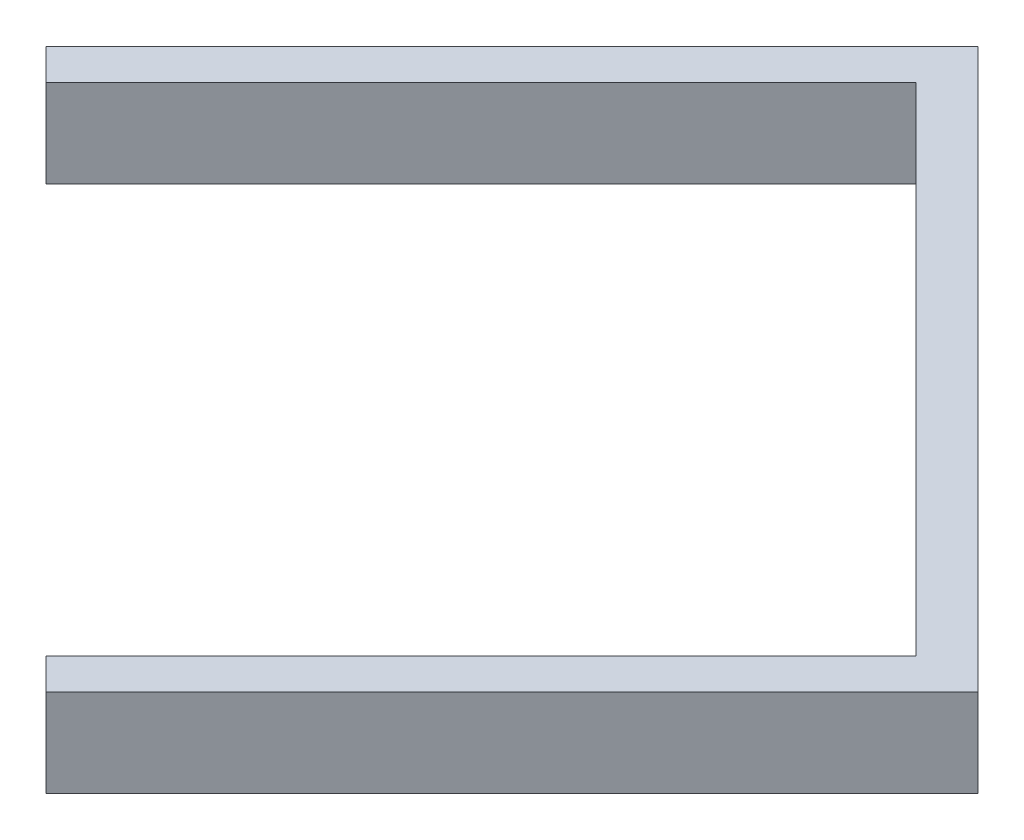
ISO-10303-21;
HEADER;
FILE_DESCRIPTION(('STEP AP214'),'2;1');
FILE_NAME('part.step','',(''),(''),'','','');
FILE_SCHEMA(('AUTOMOTIVE_DESIGN { 1 0 10303 214 1 1 1 1 }'));
ENDSEC;
DATA;
#1=APPLICATION_CONTEXT('core data for automotive mechanical design processes');
#2=APPLICATION_PROTOCOL_DEFINITION('international standard','automotive_design',2000,#1);
#3=PRODUCT_CONTEXT('',#1,'mechanical');
#4=PRODUCT('Part','Part','',(#3));
#5=PRODUCT_RELATED_PRODUCT_CATEGORY('part','',(#4));
#6=PRODUCT_DEFINITION_FORMATION('','',#4);
#7=PRODUCT_DEFINITION_CONTEXT('part definition',#1,'design');
#8=PRODUCT_DEFINITION('design','',#6,#7);
#9=PRODUCT_DEFINITION_SHAPE('','',#8);
#10=(LENGTH_UNIT() NAMED_UNIT(*) SI_UNIT(.MILLI.,.METRE.));
#11=(NAMED_UNIT(*) PLANE_ANGLE_UNIT() SI_UNIT($,.RADIAN.));
#12=(NAMED_UNIT(*) SI_UNIT($,.STERADIAN.) SOLID_ANGLE_UNIT());
#13=UNCERTAINTY_MEASURE_WITH_UNIT(LENGTH_MEASURE(1.E-05),#10,'distance_accuracy_value','');
#14=(GEOMETRIC_REPRESENTATION_CONTEXT(3) GLOBAL_UNCERTAINTY_ASSIGNED_CONTEXT((#13)) GLOBAL_UNIT_ASSIGNED_CONTEXT((#10,
#11,#12)) REPRESENTATION_CONTEXT('',''));
#15=CARTESIAN_POINT('',(0.,0.,0.));
#16=DIRECTION('',(0.,0.,1.));
#17=DIRECTION('',(1.,0.,0.));
#18=AXIS2_PLACEMENT_3D('',#15,#16,#17);
#19=CARTESIAN_POINT('',(-179.895576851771,50.8,-179.895576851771));
#20=DIRECTION('',(0.707106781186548,0.,0.707106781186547));
#21=DIRECTION('',(0.707106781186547,0.,-0.707106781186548));
#22=AXIS2_PLACEMENT_3D('',#19,#20,#21);
#23=PLANE('',#22);
#24=DIRECTION('',(-0.707106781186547,0.,0.707106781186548));
#25=VECTOR('',#24,1.);
#26=CARTESIAN_POINT('',(-179.895576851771,0.,-179.895576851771));
#27=LINE('',#26,#25);
#28=CARTESIAN_POINT('',(-60.5381574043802,0.,-299.252996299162));
#29=VERTEX_POINT('',#28);
#30=CARTESIAN_POINT('',(-311.985328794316,0.,-47.8058249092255));
#31=VERTEX_POINT('',#30);
#32=EDGE_CURVE('E145',#29,#31,#27,.T.);
#33=ORIENTED_EDGE('',*,*,#32,.F.);
#34=DIRECTION('',(0.,-1.,0.));
#35=VECTOR('',#34,1.);
#36=CARTESIAN_POINT('',(-60.5381574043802,50.8,-299.252996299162));
#37=LINE('',#36,#35);
#38=CARTESIAN_POINT('',(-60.5381574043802,50.8,-299.252996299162));
#39=VERTEX_POINT('',#38);
#40=EDGE_CURVE('E11',#39,#29,#37,.T.);
#41=ORIENTED_EDGE('',*,*,#40,.F.);
#42=DIRECTION('',(-0.707106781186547,0.,0.707106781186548));
#43=VECTOR('',#42,1.);
#44=CARTESIAN_POINT('',(-179.895576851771,50.8,-179.895576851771));
#45=LINE('',#44,#43);
#46=CARTESIAN_POINT('',(-311.985328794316,50.8,-47.8058249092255));
#47=VERTEX_POINT('',#46);
#48=EDGE_CURVE('E174',#39,#47,#45,.T.);
#49=ORIENTED_EDGE('',*,*,#48,.T.);
#50=DIRECTION('',(0.,-1.,0.));
#51=VECTOR('',#50,1.);
#52=CARTESIAN_POINT('',(-311.985328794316,50.8,-47.8058249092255));
#53=LINE('',#52,#51);
#54=EDGE_CURVE('E64',#47,#31,#53,.T.);
#55=ORIENTED_EDGE('',*,*,#54,.T.);
#56=EDGE_LOOP('',(#33,#41,#49,#55));
#57=FACE_BOUND('',#56,.T.);
#58=ADVANCED_FACE('F47',(#57),#23,.T.);
#59=CARTESIAN_POINT('',(119.357419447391,50.8,-119.357419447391));
#60=DIRECTION('',(-0.707106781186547,0.,0.707106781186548));
#61=DIRECTION('',(0.707106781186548,0.,0.707106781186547));
#62=AXIS2_PLACEMENT_3D('',#59,#60,#61);
#63=PLANE('',#62);
#64=CARTESIAN_POINT('',(119.357419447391,25.4,-119.357419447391));
#65=DIRECTION('',(-0.707106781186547,0.,0.707106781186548));
#66=DIRECTION('',(0.707106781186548,0.,0.707106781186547));
#67=AXIS2_PLACEMENT_3D('',#64,#65,#66);
#68=CIRCLE('',#67,6.35000000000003);
#69=CARTESIAN_POINT('',(114.867291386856,25.4,-123.847547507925));
#70=VERTEX_POINT('',#69);
#71=EDGE_CURVE('E149',#70,#70,#68,.T.);
#72=ORIENTED_EDGE('',*,*,#71,.F.);
#73=EDGE_LOOP('',(#72));
#74=FACE_BOUND('',#73,.T.);
#75=DIRECTION('',(-0.707106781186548,0.,-0.707106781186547));
#76=VECTOR('',#75,1.);
#77=CARTESIAN_POINT('',(119.357419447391,0.,-119.357419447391));
#78=LINE('',#77,#76);
#79=CARTESIAN_POINT('',(226.830038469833,0.,-11.884800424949));
#80=VERTEX_POINT('',#79);
#81=EDGE_CURVE('E148',#80,#29,#78,.T.);
#82=ORIENTED_EDGE('',*,*,#81,.F.);
#83=DIRECTION('',(0.,-1.,0.));
#84=VECTOR('',#83,1.);
#85=CARTESIAN_POINT('',(226.830038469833,50.8,-11.884800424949));
#86=LINE('',#85,#84);
#87=CARTESIAN_POINT('',(226.830038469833,50.8,-11.884800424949));
#88=VERTEX_POINT('',#87);
#89=EDGE_CURVE('E56',#88,#80,#86,.T.);
#90=ORIENTED_EDGE('',*,*,#89,.F.);
#91=DIRECTION('',(-0.707106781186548,0.,-0.707106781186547));
#92=VECTOR('',#91,1.);
#93=CARTESIAN_POINT('',(119.357419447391,50.8,-119.357419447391));
#94=LINE('',#93,#92);
#95=EDGE_CURVE('E206',#88,#39,#94,.T.);
#96=ORIENTED_EDGE('',*,*,#95,.T.);
#97=ORIENTED_EDGE('',*,*,#40,.T.);
#98=EDGE_LOOP('',(#82,#90,#96,#97));
#99=FACE_BOUND('',#98,.T.);
#100=ADVANCED_FACE('F197',(#74,#99),#63,.T.);
#101=CARTESIAN_POINT('',(107.472619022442,50.8,107.472619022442));
#102=DIRECTION('',(-0.707106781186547,0.,-0.707106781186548));
#103=DIRECTION('',(-0.707106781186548,0.,0.707106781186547));
#104=AXIS2_PLACEMENT_3D('',#101,#102,#103);
#105=PLANE('',#104);
#106=DIRECTION('',(0.707106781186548,0.,-0.707106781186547));
#107=VECTOR('',#106,1.);
#108=CARTESIAN_POINT('',(107.472619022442,0.,107.472619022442));
#109=LINE('',#108,#107);
#110=CARTESIAN_POINT('',(-24.6171329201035,0.,239.562370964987));
#111=VERTEX_POINT('',#110);
#112=EDGE_CURVE('E153',#111,#80,#109,.T.);
#113=ORIENTED_EDGE('',*,*,#112,.F.);
#114=DIRECTION('',(0.,-1.,0.));
#115=VECTOR('',#114,1.);
#116=CARTESIAN_POINT('',(-24.6171329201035,50.8,239.562370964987));
#117=LINE('',#116,#115);
#118=CARTESIAN_POINT('',(-24.6171329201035,50.8,239.562370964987));
#119=VERTEX_POINT('',#118);
#120=EDGE_CURVE('E184',#119,#111,#117,.T.);
#121=ORIENTED_EDGE('',*,*,#120,.F.);
#122=DIRECTION('',(0.707106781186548,0.,-0.707106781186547));
#123=VECTOR('',#122,1.);
#124=CARTESIAN_POINT('',(107.472619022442,50.8,107.472619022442));
#125=LINE('',#124,#123);
#126=EDGE_CURVE('E193',#119,#88,#125,.T.);
#127=ORIENTED_EDGE('',*,*,#126,.T.);
#128=ORIENTED_EDGE('',*,*,#89,.T.);
#129=EDGE_LOOP('',(#113,#121,#127,#128));
#130=FACE_BOUND('',#129,.T.);
#131=ADVANCED_FACE('F191',(#130),#105,.T.);
#132=CARTESIAN_POINT('',(-132.089751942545,50.8,132.089751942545));
#133=DIRECTION('',(-0.707106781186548,0.,0.707106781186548));
#134=DIRECTION('',(0.707106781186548,0.,0.707106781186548));
#135=AXIS2_PLACEMENT_3D('',#132,#133,#134);
#136=PLANE('',#135);
#137=DIRECTION('',(-0.707106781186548,0.,-0.707106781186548));
#138=VECTOR('',#137,1.);
#139=CARTESIAN_POINT('',(-132.089751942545,0.,132.089751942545));
#140=LINE('',#139,#138);
#141=CARTESIAN_POINT('',(-6.65662067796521,0.,257.522883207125));
#142=VERTEX_POINT('',#141);
#143=EDGE_CURVE('E157',#142,#111,#140,.T.);
#144=ORIENTED_EDGE('',*,*,#143,.F.);
#145=DIRECTION('',(0.,-1.,0.));
#146=VECTOR('',#145,1.);
#147=CARTESIAN_POINT('',(-6.65662067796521,50.8,257.522883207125));
#148=LINE('',#147,#146);
#149=CARTESIAN_POINT('',(-6.65662067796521,50.8,257.522883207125));
#150=VERTEX_POINT('',#149);
#151=EDGE_CURVE('E181',#150,#142,#148,.T.);
#152=ORIENTED_EDGE('',*,*,#151,.F.);
#153=DIRECTION('',(-0.707106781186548,0.,-0.707106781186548));
#154=VECTOR('',#153,1.);
#155=CARTESIAN_POINT('',(-132.089751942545,50.8,132.089751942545));
#156=LINE('',#155,#154);
#157=EDGE_CURVE('E205',#150,#119,#156,.T.);
#158=ORIENTED_EDGE('',*,*,#157,.T.);
#159=ORIENTED_EDGE('',*,*,#120,.T.);
#160=EDGE_LOOP('',(#144,#152,#158,#159));
#161=FACE_BOUND('',#160,.T.);
#162=ADVANCED_FACE('F203',(#161),#136,.T.);
#163=CARTESIAN_POINT('',(125.43313126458,50.8,125.43313126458));
#164=DIRECTION('',(0.707106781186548,0.,0.707106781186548));
#165=DIRECTION('',(0.707106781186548,0.,-0.707106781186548));
#166=AXIS2_PLACEMENT_3D('',#163,#164,#165);
#167=PLANE('',#166);
#168=DIRECTION('',(-0.707106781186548,0.,0.707106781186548));
#169=VECTOR('',#168,1.);
#170=CARTESIAN_POINT('',(125.43313126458,0.,125.43313126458));
#171=LINE('',#170,#169);
#172=CARTESIAN_POINT('',(262.751062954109,0.,-11.8848004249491));
#173=VERTEX_POINT('',#172);
#174=EDGE_CURVE('E161',#173,#142,#171,.T.);
#175=ORIENTED_EDGE('',*,*,#174,.F.);
#176=DIRECTION('',(0.,-1.,0.));
#177=VECTOR('',#176,1.);
#178=CARTESIAN_POINT('',(262.751062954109,50.8,-11.8848004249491));
#179=LINE('',#178,#177);
#180=CARTESIAN_POINT('',(262.751062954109,50.8,-11.8848004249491));
#181=VERTEX_POINT('',#180);
#182=EDGE_CURVE('E124',#181,#173,#179,.T.);
#183=ORIENTED_EDGE('',*,*,#182,.F.);
#184=DIRECTION('',(-0.707106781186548,0.,0.707106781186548));
#185=VECTOR('',#184,1.);
#186=CARTESIAN_POINT('',(125.43313126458,50.8,125.43313126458));
#187=LINE('',#186,#185);
#188=EDGE_CURVE('E134',#181,#150,#187,.T.);
#189=ORIENTED_EDGE('',*,*,#188,.T.);
#190=ORIENTED_EDGE('',*,*,#151,.T.);
#191=EDGE_LOOP('',(#175,#183,#189,#190));
#192=FACE_BOUND('',#191,.T.);
#193=ADVANCED_FACE('F216',(#192),#167,.T.);
#194=CARTESIAN_POINT('',(137.317931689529,50.8,-137.317931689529));
#195=DIRECTION('',(0.707106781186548,0.,-0.707106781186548));
#196=DIRECTION('',(-0.707106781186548,0.,-0.707106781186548));
#197=AXIS2_PLACEMENT_3D('',#194,#195,#196);
#198=PLANE('',#197);
#199=CARTESIAN_POINT('',(137.317931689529,25.4,-137.317931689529));
#200=DIRECTION('',(0.707106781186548,0.,-0.707106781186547));
#201=DIRECTION('',(-0.707106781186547,0.,-0.707106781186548));
#202=AXIS2_PLACEMENT_3D('',#199,#200,#201);
#203=CIRCLE('',#202,6.35000000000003);
#204=CARTESIAN_POINT('',(132.827803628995,25.4,-141.808059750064));
#205=VERTEX_POINT('',#204);
#206=EDGE_CURVE('E250',#205,#205,#203,.T.);
#207=ORIENTED_EDGE('',*,*,#206,.F.);
#208=EDGE_LOOP('',(#207));
#209=FACE_BOUND('',#208,.T.);
#210=DIRECTION('',(0.707106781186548,0.,0.707106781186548));
#211=VECTOR('',#210,1.);
#212=CARTESIAN_POINT('',(137.317931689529,0.,-137.317931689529));
#213=LINE('',#212,#211);
#214=CARTESIAN_POINT('',(-60.5381574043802,0.,-335.174020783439));
#215=VERTEX_POINT('',#214);
#216=EDGE_CURVE('E119',#215,#173,#213,.T.);
#217=ORIENTED_EDGE('',*,*,#216,.F.);
#218=DIRECTION('',(0.,-1.,0.));
#219=VECTOR('',#218,1.);
#220=CARTESIAN_POINT('',(-60.5381574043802,50.8,-335.174020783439));
#221=LINE('',#220,#219);
#222=CARTESIAN_POINT('',(-60.5381574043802,50.8,-335.174020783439));
#223=VERTEX_POINT('',#222);
#224=EDGE_CURVE('E114',#223,#215,#221,.T.);
#225=ORIENTED_EDGE('',*,*,#224,.F.);
#226=DIRECTION('',(0.707106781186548,0.,0.707106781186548));
#227=VECTOR('',#226,1.);
#228=CARTESIAN_POINT('',(137.317931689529,50.8,-137.317931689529));
#229=LINE('',#228,#227);
#230=EDGE_CURVE('E117',#223,#181,#229,.T.);
#231=ORIENTED_EDGE('',*,*,#230,.T.);
#232=ORIENTED_EDGE('',*,*,#182,.T.);
#233=EDGE_LOOP('',(#217,#225,#231,#232));
#234=FACE_BOUND('',#233,.T.);
#235=ADVANCED_FACE('F116',(#209,#234),#198,.T.);
#236=CARTESIAN_POINT('',(-197.856089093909,50.8,-197.856089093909));
#237=DIRECTION('',(-0.707106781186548,0.,-0.707106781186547));
#238=DIRECTION('',(-0.707106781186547,0.,0.707106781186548));
#239=AXIS2_PLACEMENT_3D('',#236,#237,#238);
#240=PLANE('',#239);
#241=DIRECTION('',(0.707106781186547,0.,-0.707106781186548));
#242=VECTOR('',#241,1.);
#243=CARTESIAN_POINT('',(-197.856089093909,0.,-197.856089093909));
#244=LINE('',#243,#242);
#245=CARTESIAN_POINT('',(-329.945841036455,0.,-65.7663371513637));
#246=VERTEX_POINT('',#245);
#247=EDGE_CURVE('E167',#246,#215,#244,.T.);
#248=ORIENTED_EDGE('',*,*,#247,.F.);
#249=DIRECTION('',(0.,-1.,0.));
#250=VECTOR('',#249,1.);
#251=CARTESIAN_POINT('',(-329.945841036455,50.8,-65.7663371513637));
#252=LINE('',#251,#250);
#253=CARTESIAN_POINT('',(-329.945841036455,50.8,-65.7663371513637));
#254=VERTEX_POINT('',#253);
#255=EDGE_CURVE('E89',#254,#246,#252,.T.);
#256=ORIENTED_EDGE('',*,*,#255,.F.);
#257=DIRECTION('',(0.707106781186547,0.,-0.707106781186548));
#258=VECTOR('',#257,1.);
#259=CARTESIAN_POINT('',(-197.856089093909,50.8,-197.856089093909));
#260=LINE('',#259,#258);
#261=EDGE_CURVE('E131',#254,#223,#260,.T.);
#262=ORIENTED_EDGE('',*,*,#261,.T.);
#263=ORIENTED_EDGE('',*,*,#224,.T.);
#264=EDGE_LOOP('',(#248,#256,#262,#263));
#265=FACE_BOUND('',#264,.T.);
#266=ADVANCED_FACE('F137',(#265),#240,.T.);
#267=CARTESIAN_POINT('',(-132.089751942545,50.8,132.089751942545));
#268=DIRECTION('',(-0.707106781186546,0.,0.707106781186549));
#269=DIRECTION('',(0.707106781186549,0.,0.707106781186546));
#270=AXIS2_PLACEMENT_3D('',#267,#268,#269);
#271=PLANE('',#270);
#272=DIRECTION('',(-0.707106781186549,0.,-0.707106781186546));
#273=VECTOR('',#272,1.);
#274=CARTESIAN_POINT('',(-132.089751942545,0.,132.089751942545));
#275=LINE('',#274,#273);
#276=EDGE_CURVE('E170',#31,#246,#275,.T.);
#277=ORIENTED_EDGE('',*,*,#276,.F.);
#278=ORIENTED_EDGE('',*,*,#54,.F.);
#279=DIRECTION('',(-0.707106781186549,0.,-0.707106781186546));
#280=VECTOR('',#279,1.);
#281=CARTESIAN_POINT('',(-132.089751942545,50.8,132.089751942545));
#282=LINE('',#281,#280);
#283=EDGE_CURVE('E139',#47,#254,#282,.T.);
#284=ORIENTED_EDGE('',*,*,#283,.T.);
#285=ORIENTED_EDGE('',*,*,#255,.T.);
#286=EDGE_LOOP('',(#277,#278,#284,#285));
#287=FACE_BOUND('',#286,.T.);
#288=ADVANCED_FACE('F217',(#287),#271,.T.);
#289=CARTESIAN_POINT('',(0.,50.8,0.));
#290=DIRECTION('',(0.,1.,0.));
#291=DIRECTION('',(0.,0.,1.));
#292=AXIS2_PLACEMENT_3D('',#289,#290,#291);
#293=PLANE('',#292);
#294=ORIENTED_EDGE('',*,*,#48,.F.);
#295=ORIENTED_EDGE('',*,*,#95,.F.);
#296=ORIENTED_EDGE('',*,*,#126,.F.);
#297=ORIENTED_EDGE('',*,*,#157,.F.);
#298=ORIENTED_EDGE('',*,*,#188,.F.);
#299=ORIENTED_EDGE('',*,*,#230,.F.);
#300=ORIENTED_EDGE('',*,*,#261,.F.);
#301=ORIENTED_EDGE('',*,*,#283,.F.);
#302=EDGE_LOOP('',(#294,#295,#296,#297,#298,#299,#300,#301));
#303=FACE_BOUND('',#302,.T.);
#304=ADVANCED_FACE('F129',(#303),#293,.T.);
#305=CARTESIAN_POINT('',(0.,0.,0.));
#306=DIRECTION('',(0.,1.,0.));
#307=DIRECTION('',(0.,0.,1.));
#308=AXIS2_PLACEMENT_3D('',#305,#306,#307);
#309=PLANE('',#308);
#310=ORIENTED_EDGE('',*,*,#32,.T.);
#311=ORIENTED_EDGE('',*,*,#276,.T.);
#312=ORIENTED_EDGE('',*,*,#247,.T.);
#313=ORIENTED_EDGE('',*,*,#216,.T.);
#314=ORIENTED_EDGE('',*,*,#174,.T.);
#315=ORIENTED_EDGE('',*,*,#143,.T.);
#316=ORIENTED_EDGE('',*,*,#112,.T.);
#317=ORIENTED_EDGE('',*,*,#81,.T.);
#318=EDGE_LOOP('',(#310,#311,#312,#313,#314,#315,#316,#317));
#319=FACE_BOUND('',#318,.T.);
#320=ADVANCED_FACE('F199',(#319),#309,.F.);
#321=CARTESIAN_POINT('',(101.396907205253,25.4,-101.396907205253));
#322=DIRECTION('',(0.707106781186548,0.,-0.707106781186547));
#323=DIRECTION('',(-0.707106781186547,0.,-0.707106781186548));
#324=AXIS2_PLACEMENT_3D('',#321,#322,#323);
#325=CYLINDRICAL_SURFACE('',#324,6.35000000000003);
#326=CARTESIAN_POINT('',(114.867291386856,25.4,-123.847547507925));
#327=CARTESIAN_POINT('',(115.054380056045,25.4,-124.034636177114));
#328=CARTESIAN_POINT('',(115.241468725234,25.4,-124.221724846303));
#329=CARTESIAN_POINT('',(115.615646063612,25.4,-124.595902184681));
#330=CARTESIAN_POINT('',(115.802734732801,25.4,-124.78299085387));
#331=CARTESIAN_POINT('',(116.176912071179,25.4,-125.157168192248));
#332=CARTESIAN_POINT('',(116.364000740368,25.4,-125.344256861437));
#333=CARTESIAN_POINT('',(116.738178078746,25.4,-125.718434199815));
#334=CARTESIAN_POINT('',(116.925266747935,25.4,-125.905522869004));
#335=CARTESIAN_POINT('',(117.299444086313,25.4,-126.279700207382));
#336=CARTESIAN_POINT('',(117.486532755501,25.4,-126.466788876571));
#337=CARTESIAN_POINT('',(117.860710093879,25.4,-126.840966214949));
#338=CARTESIAN_POINT('',(118.047798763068,25.4,-127.028054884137));
#339=CARTESIAN_POINT('',(118.421976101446,25.4,-127.402232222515));
#340=CARTESIAN_POINT('',(118.609064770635,25.4,-127.589320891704));
#341=CARTESIAN_POINT('',(118.983242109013,25.4,-127.963498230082));
#342=CARTESIAN_POINT('',(119.170330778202,25.4,-128.150586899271));
#343=CARTESIAN_POINT('',(119.54450811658,25.4,-128.524764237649));
#344=CARTESIAN_POINT('',(119.731596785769,25.4,-128.711852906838));
#345=CARTESIAN_POINT('',(120.105774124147,25.4,-129.086030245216));
#346=CARTESIAN_POINT('',(120.292862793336,25.4,-129.273118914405));
#347=CARTESIAN_POINT('',(120.667040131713,25.4,-129.647296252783));
#348=CARTESIAN_POINT('',(120.854128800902,25.4,-129.834384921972));
#349=CARTESIAN_POINT('',(121.22830613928,25.4,-130.208562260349));
#350=CARTESIAN_POINT('',(121.415394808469,25.4,-130.395650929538));
#351=CARTESIAN_POINT('',(121.789572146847,25.4,-130.769828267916));
#352=CARTESIAN_POINT('',(121.976660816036,25.4,-130.956916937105));
#353=CARTESIAN_POINT('',(122.350838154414,25.4,-131.331094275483));
#354=CARTESIAN_POINT('',(122.537926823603,25.4,-131.518182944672));
#355=CARTESIAN_POINT('',(122.912104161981,25.4,-131.89236028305));
#356=CARTESIAN_POINT('',(123.09919283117,25.4,-132.079448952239));
#357=CARTESIAN_POINT('',(123.473370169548,25.4,-132.453626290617));
#358=CARTESIAN_POINT('',(123.660458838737,25.4,-132.640714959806));
#359=CARTESIAN_POINT('',(124.034636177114,25.4,-133.014892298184));
#360=CARTESIAN_POINT('',(124.221724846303,25.4,-133.201980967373));
#361=CARTESIAN_POINT('',(124.595902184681,25.4,-133.57615830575));
#362=CARTESIAN_POINT('',(124.78299085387,25.4,-133.763246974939));
#363=CARTESIAN_POINT('',(125.157168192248,25.4,-134.137424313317));
#364=CARTESIAN_POINT('',(125.344256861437,25.4,-134.324512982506));
#365=CARTESIAN_POINT('',(125.718434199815,25.4,-134.698690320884));
#366=CARTESIAN_POINT('',(125.905522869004,25.4,-134.885778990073));
#367=CARTESIAN_POINT('',(126.279700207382,25.4,-135.259956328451));
#368=CARTESIAN_POINT('',(126.466788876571,25.4,-135.44704499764));
#369=CARTESIAN_POINT('',(126.840966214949,25.4,-135.821222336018));
#370=CARTESIAN_POINT('',(127.028054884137,25.4,-136.008311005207));
#371=CARTESIAN_POINT('',(127.402232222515,25.4,-136.382488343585));
#372=CARTESIAN_POINT('',(127.589320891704,25.4,-136.569577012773));
#373=CARTESIAN_POINT('',(127.963498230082,25.4,-136.943754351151));
#374=CARTESIAN_POINT('',(128.150586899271,25.4,-137.13084302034));
#375=CARTESIAN_POINT('',(128.524764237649,25.4,-137.505020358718));
#376=CARTESIAN_POINT('',(128.711852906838,25.4,-137.692109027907));
#377=CARTESIAN_POINT('',(129.086030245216,25.4,-138.066286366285));
#378=CARTESIAN_POINT('',(129.273118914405,25.4,-138.253375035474));
#379=CARTESIAN_POINT('',(129.647296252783,25.4,-138.627552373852));
#380=CARTESIAN_POINT('',(129.834384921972,25.4,-138.814641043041));
#381=CARTESIAN_POINT('',(130.20856226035,25.4,-139.188818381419));
#382=CARTESIAN_POINT('',(130.395650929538,25.4,-139.375907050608));
#383=CARTESIAN_POINT('',(130.769828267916,25.4,-139.750084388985));
#384=CARTESIAN_POINT('',(130.956916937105,25.4,-139.937173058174));
#385=CARTESIAN_POINT('',(131.331094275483,25.4,-140.311350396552));
#386=CARTESIAN_POINT('',(131.518182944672,25.4,-140.498439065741));
#387=CARTESIAN_POINT('',(131.89236028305,25.4,-140.872616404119));
#388=CARTESIAN_POINT('',(132.079448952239,25.4,-141.059705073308));
#389=CARTESIAN_POINT('',(132.453626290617,25.4,-141.433882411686));
#390=CARTESIAN_POINT('',(132.640714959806,25.4,-141.620971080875));
#391=CARTESIAN_POINT('',(132.827803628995,25.4,-141.808059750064));
#392=B_SPLINE_CURVE_WITH_KNOTS('',3,(#326,#327,#328,#329,#330,#331,#332,#333,#334,#335,#336,
#337,#338,#339,#340,#341,#342,#343,#344,#345,#346,#347,#348,#349,#350,#351,#352,#353,#354,#355,
#356,#357,#358,#359,#360,#361,#362,#363,#364,#365,#366,#367,#368,#369,#370,#371,#372,#373,#374,
#375,#376,#377,#378,#379,#380,#381,#382,#383,#384,#385,#386,#387,#388,#389,#390,#391),
.UNSPECIFIED.,.F.,.F.,(4,2,2,2,2,2,2,2,2,2,2,2,2,2,2,2,2,2,2,2,2,2,2,2,2,2,2,2,2,2,2,2,4),(0.,
0.793750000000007,1.5875,2.38125000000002,3.17500000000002,3.96875,4.76250000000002,
5.55625000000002,6.35,7.14375000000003,7.93750000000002,8.73125000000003,9.52500000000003,
10.31875,11.1125,11.90625,12.7,13.49375,14.2875,15.08125,15.875,16.66875,17.4625,18.25625,19.05,
19.8437500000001,20.6375,21.4312500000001,22.2250000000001,23.01875,23.8125,24.6062500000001,
25.4),.UNSPECIFIED.);
#393=EDGE_CURVE('BSEAM259',#70,#205,#392,.T.);
#394=ORIENTED_EDGE('',*,*,#71,.T.);
#395=ORIENTED_EDGE('',*,*,#206,.T.);
#396=ORIENTED_EDGE('',*,*,#393,.T.);
#397=ORIENTED_EDGE('',*,*,#393,.F.);
#398=EDGE_LOOP('',(#394,#396,#395,#397));
#399=FACE_BOUND('',#398,.T.);
#400=ADVANCED_FACE('F259',(#399),#325,.F.);
#401=CLOSED_SHELL('',(#58,#100,#131,#162,#193,#235,#266,#288,#304,#320,#400));
#402=MANIFOLD_SOLID_BREP('B2',#401);
#403=ADVANCED_BREP_SHAPE_REPRESENTATION('',(#18,#402),#14);
#404=SHAPE_DEFINITION_REPRESENTATION(#9,#403);
ENDSEC;
END-ISO-10303-21;
